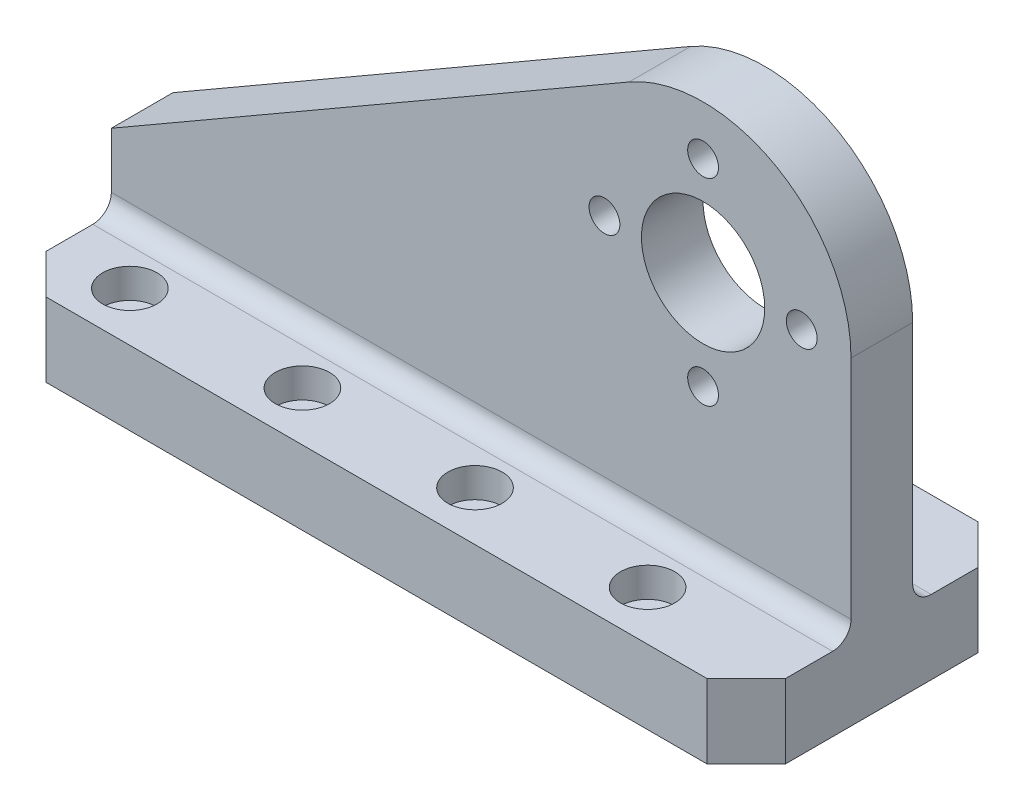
from build123d import *

# Parameters (mm, degrees)
SKETCH1_R                                           = 5
BOSS_EXTRUDE1_DEPTH                                 = 2.5
SKETCH2_W                                           = 60
SKETCH2_H                                           = 22
BOSS_EXTRUDE2_DEPTH                                 = 6
CHAMFER1_SIZE                                       = 3.2
CBORE_FOR_M2_HEX_SOCKET_HEAD_CAP_SCREW1_D           = 2.4
CBORE_FOR_M2_HEX_SOCKET_HEAD_CAP_SCREW1_CBORE_D     = 4.4
CBORE_FOR_M2_HEX_SOCKET_HEAD_CAP_SCREW1_CBORE_DEPTH = 2.4
LPATTERN1_COUNT                                     = 4
LPATTERN1_PITCH                                     = 14
MIRROR1_COPY_1_D                                    = 2.4
MIRROR1_COPY_1_CBORE_D                              = 4.4
MIRROR1_COPY_1_CBORE_DEPTH                          = 2.4
MIRROR1_COPY_2_D                                    = 2.4
MIRROR1_COPY_2_CBORE_D                              = 4.4
MIRROR1_COPY_2_CBORE_DEPTH                          = 2.4
MIRROR1_COPY_3_D                                    = 2.4
MIRROR1_COPY_3_CBORE_D                              = 4.4
MIRROR1_COPY_3_CBORE_DEPTH                          = 2.4
M3_TAPPED_HOLE1_D                                   = 2.5
CIRPATTERN1_COUNT                                   = 4
FILLET1_R                                           = 1.5


with BuildPart() as part:
    # Sketch1 → Boss-Extrude1 (new, symmetric)
    with BuildSketch(Plane.XY):
        with BuildLine():
            Line((0, 0), (60, 0))
            Line((60, 0), (60, 25.856406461))
            ThreePointArc((60, 25.856406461), (54, 36.248711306), (42, 36.248711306))
            Line((42, 36.248711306), (0, 12))
            Line((0, 12), (0, 0))
        make_face()
        with Locations((48, 25.856406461)):
            Circle(SKETCH1_R, mode=Mode.SUBTRACT)
    extrude(amount=BOSS_EXTRUDE1_DEPTH, both=True)

    # Sketch2 → Boss-Extrude2 (add)
    with BuildSketch(Plane(origin=(0, 0, 0), x_dir=(1, 0, 0), z_dir=(0, 1, 0))):
        with Locations((30, 0)):
            Rectangle(SKETCH2_W, SKETCH2_H)
    extrude(amount=BOSS_EXTRUDE2_DEPTH)

    # Chamfer1
    chamfer1_edges = [part.edges().sort_by_distance(p)[0] for p in [
        (0, 3, -11),
        (0, 3, 11),
        (60, 3, 11),
        (60, 3, -11),
    ]]
    chamfer(chamfer1_edges, length=CHAMFER1_SIZE)

    # CBORE for M2 Hex Socket Head Cap Screw1 (through all)
    with Locations(Plane(origin=(0, 6, 0), x_dir=(1, 0, 0), z_dir=(0, 1, 0))):
        with Locations((48, -7)):
            cbore_for_m2_hex_socket_head_cap_screw1 = CounterBoreHole(CBORE_FOR_M2_HEX_SOCKET_HEAD_CAP_SCREW1_D / 2, CBORE_FOR_M2_HEX_SOCKET_HEAD_CAP_SCREW1_CBORE_D / 2, CBORE_FOR_M2_HEX_SOCKET_HEAD_CAP_SCREW1_CBORE_DEPTH)

    # LPattern1: CBORE for M2 Hex Socket Head Cap Screw1 ×4
    with Locations(*[(-i * LPATTERN1_PITCH, 0, 0) for i in range(1, LPATTERN1_COUNT)]):
        add(cbore_for_m2_hex_socket_head_cap_screw1, mode=Mode.SUBTRACT)

    # Mirror1: CBORE for M2 Hex Socket Head Cap Screw1 across plane
    add(cbore_for_m2_hex_socket_head_cap_screw1.mirror(Plane.XY), mode=Mode.SUBTRACT)

    # Mirror1 copy 1 (through all)
    with Locations(Plane(origin=(-14, 6, 0), x_dir=(1, 0, 0), z_dir=(0, 1, 0))):
        with Locations((48, 7)):
            CounterBoreHole(MIRROR1_COPY_1_D / 2, MIRROR1_COPY_1_CBORE_D / 2, MIRROR1_COPY_1_CBORE_DEPTH)

    # Mirror1 copy 2 (through all)
    with Locations(Plane(origin=(-28, 6, 0), x_dir=(1, 0, 0), z_dir=(0, 1, 0))):
        with Locations((48, 7)):
            CounterBoreHole(MIRROR1_COPY_2_D / 2, MIRROR1_COPY_2_CBORE_D / 2, MIRROR1_COPY_2_CBORE_DEPTH)

    # Mirror1 copy 3 (through all)
    with Locations(Plane(origin=(-42, 6, 0), x_dir=(1, 0, 0), z_dir=(0, 1, 0))):
        with Locations((48, 7)):
            CounterBoreHole(MIRROR1_COPY_3_D / 2, MIRROR1_COPY_3_CBORE_D / 2, MIRROR1_COPY_3_CBORE_DEPTH)

    # M3 Tapped Hole1 (through all)
    with Locations(Plane.XY.offset(2.5)):
        with Locations((56, 25.856406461)):
            m3_tapped_hole1 = Hole(M3_TAPPED_HOLE1_D / 2)

    # CirPattern1: M3 Tapped Hole1 ×4 about axis
    cirpattern1_axis = Axis((48, 25.856406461, 0), (0, 0, 1))
    for i in range(1, CIRPATTERN1_COUNT):
        add(m3_tapped_hole1.rotate(cirpattern1_axis, i * 360 / CIRPATTERN1_COUNT), mode=Mode.SUBTRACT)

    # Fillet1
    fillet1_edges = [part.edges().sort_by_distance(p)[0] for p in [
        (30, 6, -2.5),
        (30, 6, 2.5),
    ]]
    fillet(fillet1_edges, radius=FILLET1_R)


solid = part.part
